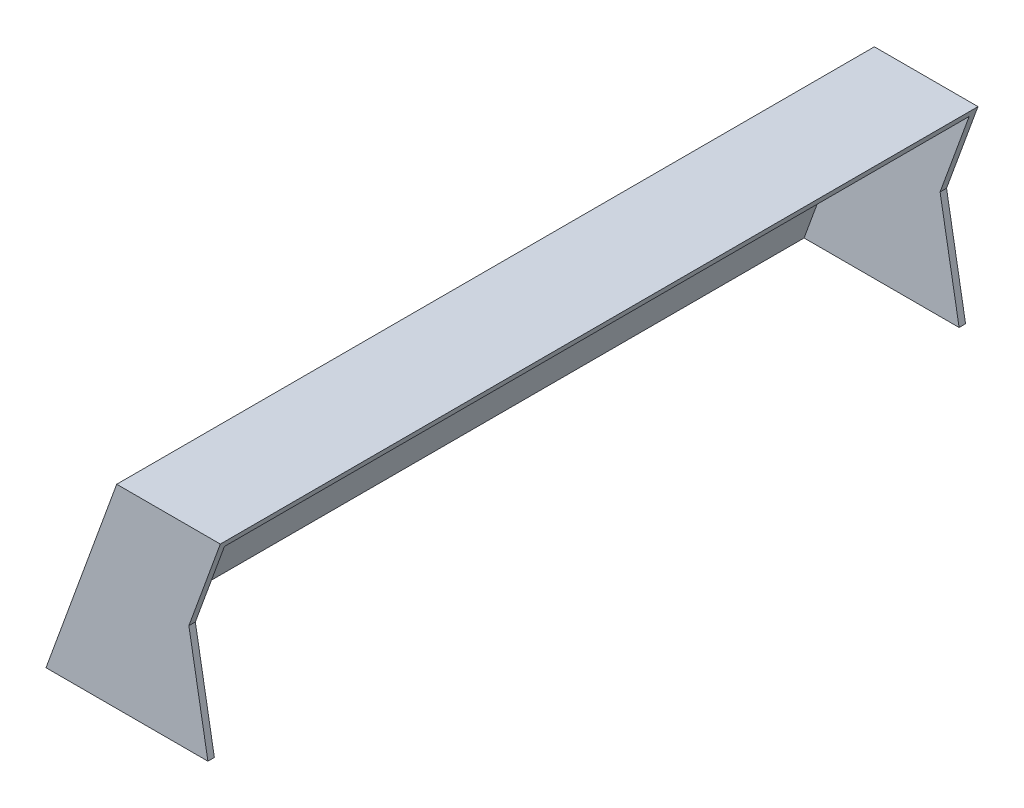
from build123d import *

# Parameters (mm, degrees)
BOSS_EXTRUDE1_DEPTH = 1170
SHELL1_T            = -10
CUT_EXTRUDE1_REACH  = 1239.483


with BuildPart() as part:
    # Sketch1 → Boss-Extrude1 (new body)
    with BuildSketch(Plane.XY):
        Polygon((0, 0), (250, 0), (220.62833599, 166.574984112), (269.19107028, 300), (109.19107028, 300), align=None)
    extrude(amount=BOSS_EXTRUDE1_DEPTH)

    # Shell1
    shell1_openings = [part.faces().sort_by_distance(p)[0] for p in [
        (125, 0, 585),
        (244.909703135, 233.287492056, 585),
        (235.314167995, 83.287492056, 585),
    ]]
    offset(amount=SHELL1_T, openings=shell1_openings, kind=Kind.INTERSECTION)

    # Sketch2 → Cut-Extrude1 (cut, up to next)
    with BuildSketch(Plane(origin=(0, 0, 0), x_dir=(0, 0, 1), z_dir=(-0.9396926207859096, 0.34202014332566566, 0)), mode=Mode.PRIVATE) as cut_extrude1_sk1:
        with BuildLine():
            Line((1110, 219.253331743), (1110, 144.253331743))
            ThreePointArc((1110, 144.253331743), (1050, 84.253331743), (990, 144.253331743))
            Line((990, 144.253331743), (990, 219.253331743))
            ThreePointArc((990, 219.253331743), (1050, 279.253331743), (1110, 219.253331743))
        make_face()
    cut_extrude1_tool1 = extrude(cut_extrude1_sk1.sketch, amount=-CUT_EXTRUDE1_REACH, mode=Mode.PRIVATE) & part.part
    # Sketch2 → Cut-Extrude1 (cut, up to next)
    with BuildSketch(Plane(origin=(0, 0, 0), x_dir=(0, 0, 1), z_dir=(-0.9396926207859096, 0.34202014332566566, 0)), mode=Mode.PRIVATE) as cut_extrude1_sk2:
        with BuildLine():
            Line((60, 219.253331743), (60, 144.253331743))
            ThreePointArc((60, 144.253331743), (120, 84.253331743), (180, 144.253331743))
            Line((180, 144.253331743), (180, 219.253331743))
            ThreePointArc((180, 219.253331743), (120, 279.253331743), (60, 219.253331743))
        make_face()
    cut_extrude1_tool2 = extrude(cut_extrude1_sk2.sketch, amount=-CUT_EXTRUDE1_REACH, mode=Mode.PRIVATE) & part.part
    add(cut_extrude1_tool1.solids().sort_by_distance((62.163301, 170.792265, 1050))[0], mode=Mode.SUBTRACT)
    add(cut_extrude1_tool2.solids().sort_by_distance((62.163301, 170.792265, 120))[0], mode=Mode.SUBTRACT)


solid = part.part
